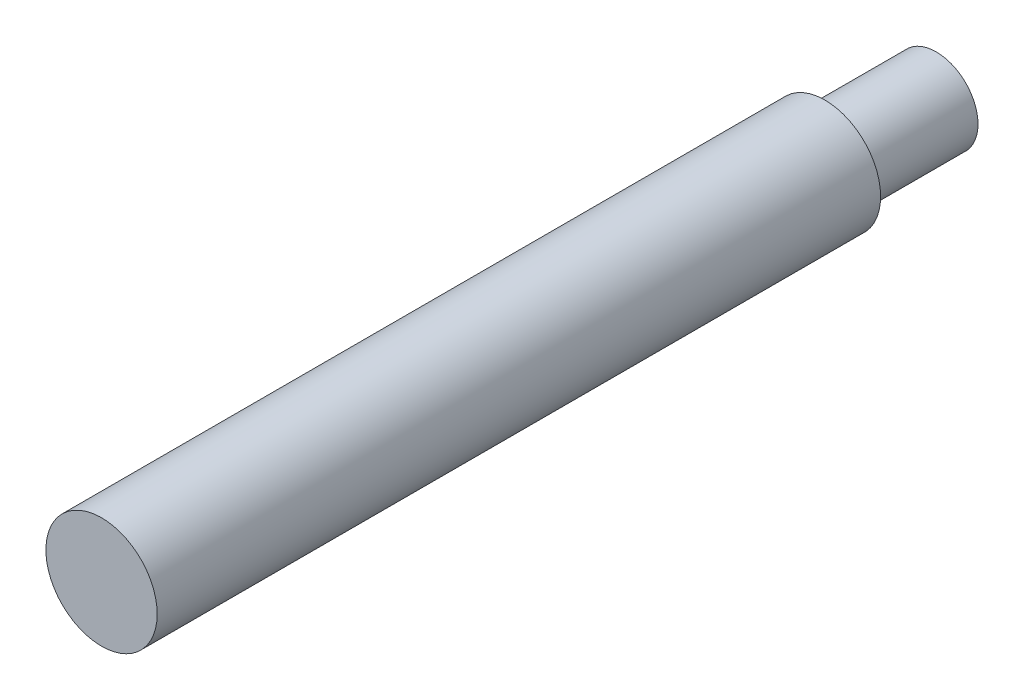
from build123d import *

# Parameters (mm, degrees)
SKETCH1_R           = 12.7
BASE_EXTRUDE_DEPTH  = 165.1
SKETCH2_R           = 9.525
BOSS_EXTRUDE1_DEPTH = 25.4


with BuildPart() as part:
    # Sketch1 → Base-Extrude (new body)
    with BuildSketch(Plane.XY):
        Circle(SKETCH1_R)
    extrude(amount=BASE_EXTRUDE_DEPTH)

    # Sketch2 → Boss-Extrude1 (add)
    with BuildSketch(Plane(origin=(0, 0, 0), x_dir=(-1, 0, 0), z_dir=(0, 0, -1))):
        with Locations(Location((0, 0, 0), (0, 0, 180))):
            Circle(SKETCH2_R)
    extrude(amount=BOSS_EXTRUDE1_DEPTH)


solid = part.part
